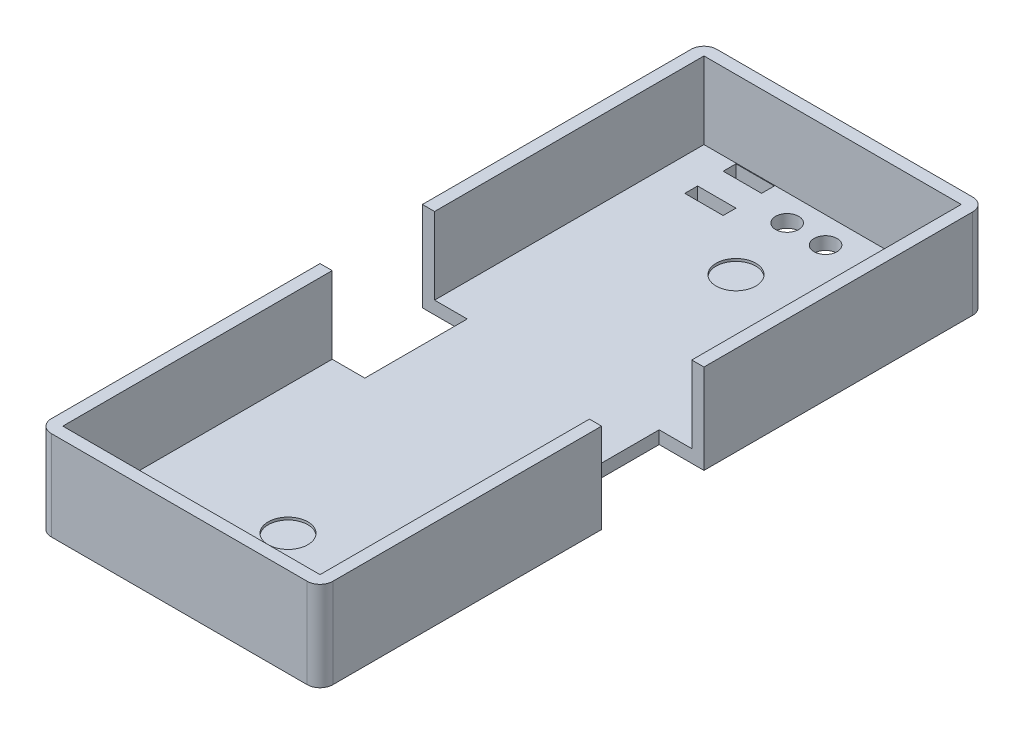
ISO-10303-21;
HEADER;
FILE_DESCRIPTION(('STEP AP214'),'2;1');
FILE_NAME('part.step','',(''),(''),'','','');
FILE_SCHEMA(('AUTOMOTIVE_DESIGN { 1 0 10303 214 1 1 1 1 }'));
ENDSEC;
DATA;
#1=APPLICATION_CONTEXT('core data for automotive mechanical design processes');
#2=APPLICATION_PROTOCOL_DEFINITION('international standard','automotive_design',2000,#1);
#3=PRODUCT_CONTEXT('',#1,'mechanical');
#4=PRODUCT('Part','Part','',(#3));
#5=PRODUCT_RELATED_PRODUCT_CATEGORY('part','',(#4));
#6=PRODUCT_DEFINITION_FORMATION('','',#4);
#7=PRODUCT_DEFINITION_CONTEXT('part definition',#1,'design');
#8=PRODUCT_DEFINITION('design','',#6,#7);
#9=PRODUCT_DEFINITION_SHAPE('','',#8);
#10=(LENGTH_UNIT() NAMED_UNIT(*) SI_UNIT(.MILLI.,.METRE.));
#11=(NAMED_UNIT(*) PLANE_ANGLE_UNIT() SI_UNIT($,.RADIAN.));
#12=(NAMED_UNIT(*) SI_UNIT($,.STERADIAN.) SOLID_ANGLE_UNIT());
#13=UNCERTAINTY_MEASURE_WITH_UNIT(LENGTH_MEASURE(1.E-05),#10,'distance_accuracy_value','');
#14=(GEOMETRIC_REPRESENTATION_CONTEXT(3) GLOBAL_UNCERTAINTY_ASSIGNED_CONTEXT((#13)) GLOBAL_UNIT_ASSIGNED_CONTEXT((#10,
#11,#12)) REPRESENTATION_CONTEXT('',''));
#15=CARTESIAN_POINT('',(0.,0.,0.));
#16=DIRECTION('',(0.,0.,1.));
#17=DIRECTION('',(1.,0.,0.));
#18=AXIS2_PLACEMENT_3D('',#15,#16,#17);
#19=CARTESIAN_POINT('',(11.,7.,26.));
#20=DIRECTION('',(-1.,0.,0.));
#21=DIRECTION('',(0.,0.,1.));
#22=AXIS2_PLACEMENT_3D('',#19,#20,#21);
#23=PLANE('',#22);
#24=DIRECTION('',(0.,0.,-1.));
#25=VECTOR('',#24,1.);
#26=CARTESIAN_POINT('',(11.,7.,26.));
#27=LINE('',#26,#25);
#28=CARTESIAN_POINT('',(11.,7.,-4.00000000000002));
#29=VERTEX_POINT('',#28);
#30=CARTESIAN_POINT('',(11.,7.,-25.));
#31=VERTEX_POINT('',#30);
#32=EDGE_CURVE('E359',#29,#31,#27,.T.);
#33=ORIENTED_EDGE('',*,*,#32,.F.);
#34=DIRECTION('',(0.,-1.,0.));
#35=VECTOR('',#34,1.);
#36=CARTESIAN_POINT('',(11.,7.,-4.00000000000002));
#37=LINE('',#36,#35);
#38=CARTESIAN_POINT('',(11.,0.,-4.00000000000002));
#39=VERTEX_POINT('',#38);
#40=EDGE_CURVE('E767',#29,#39,#37,.T.);
#41=ORIENTED_EDGE('',*,*,#40,.T.);
#42=DIRECTION('',(0.,0.,-1.));
#43=VECTOR('',#42,1.);
#44=CARTESIAN_POINT('',(11.,0.,26.));
#45=LINE('',#44,#43);
#46=CARTESIAN_POINT('',(11.,0.,-25.));
#47=VERTEX_POINT('',#46);
#48=EDGE_CURVE('E346',#39,#47,#45,.T.);
#49=ORIENTED_EDGE('',*,*,#48,.T.);
#50=DIRECTION('',(0.,-1.,0.));
#51=VECTOR('',#50,1.);
#52=CARTESIAN_POINT('',(11.,7.,-25.));
#53=LINE('',#52,#51);
#54=EDGE_CURVE('E398',#47,#31,#53,.F.);
#55=ORIENTED_EDGE('',*,*,#54,.T.);
#56=EDGE_LOOP('',(#33,#41,#49,#55));
#57=FACE_BOUND('',#56,.T.);
#58=ADVANCED_FACE('F39',(#57),#23,.F.);
#59=CARTESIAN_POINT('',(-11.,7.,26.));
#60=DIRECTION('',(1.,0.,0.));
#61=DIRECTION('',(0.,0.,-1.));
#62=AXIS2_PLACEMENT_3D('',#59,#60,#61);
#63=PLANE('',#62);
#64=DIRECTION('',(0.,0.,1.));
#65=VECTOR('',#64,1.);
#66=CARTESIAN_POINT('',(-11.,0.,26.));
#67=LINE('',#66,#65);
#68=CARTESIAN_POINT('',(-11.,0.,-25.));
#69=VERTEX_POINT('',#68);
#70=CARTESIAN_POINT('',(-11.,0.,-4.));
#71=VERTEX_POINT('',#70);
#72=EDGE_CURVE('E351',#69,#71,#67,.T.);
#73=ORIENTED_EDGE('',*,*,#72,.T.);
#74=DIRECTION('',(0.,-1.,0.));
#75=VECTOR('',#74,1.);
#76=CARTESIAN_POINT('',(-11.,7.,-4.));
#77=LINE('',#76,#75);
#78=CARTESIAN_POINT('',(-11.,7.,-4.));
#79=VERTEX_POINT('',#78);
#80=EDGE_CURVE('E307',#79,#71,#77,.T.);
#81=ORIENTED_EDGE('',*,*,#80,.F.);
#82=DIRECTION('',(0.,0.,1.));
#83=VECTOR('',#82,1.);
#84=CARTESIAN_POINT('',(-11.,7.,26.));
#85=LINE('',#84,#83);
#86=CARTESIAN_POINT('',(-11.,7.,-25.));
#87=VERTEX_POINT('',#86);
#88=EDGE_CURVE('E325',#87,#79,#85,.T.);
#89=ORIENTED_EDGE('',*,*,#88,.F.);
#90=DIRECTION('',(0.,-1.,0.));
#91=VECTOR('',#90,1.);
#92=CARTESIAN_POINT('',(-11.,7.,-25.));
#93=LINE('',#92,#91);
#94=EDGE_CURVE('E380',#87,#69,#93,.T.);
#95=ORIENTED_EDGE('',*,*,#94,.T.);
#96=EDGE_LOOP('',(#73,#81,#89,#95));
#97=FACE_BOUND('',#96,.T.);
#98=ADVANCED_FACE('F594',(#97),#63,.F.);
#99=CARTESIAN_POINT('',(0.,7.,0.));
#100=DIRECTION('',(0.,-1.,0.));
#101=DIRECTION('',(0.,0.,-1.));
#102=AXIS2_PLACEMENT_3D('',#99,#100,#101);
#103=PLANE('',#102);
#104=ORIENTED_EDGE('',*,*,#88,.T.);
#105=DIRECTION('',(1.,0.,0.));
#106=VECTOR('',#105,1.);
#107=CARTESIAN_POINT('',(-7.50000000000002,7.,-4.));
#108=LINE('',#107,#106);
#109=CARTESIAN_POINT('',(-10.05,7.,-4.));
#110=VERTEX_POINT('',#109);
#111=EDGE_CURVE('E318',#79,#110,#108,.T.);
#112=ORIENTED_EDGE('',*,*,#111,.T.);
#113=DIRECTION('',(0.,0.,1.));
#114=VECTOR('',#113,1.);
#115=CARTESIAN_POINT('',(-10.05,7.,25.05));
#116=LINE('',#115,#114);
#117=CARTESIAN_POINT('',(-10.05,7.,-25.05));
#118=VERTEX_POINT('',#117);
#119=EDGE_CURVE('E541',#118,#110,#116,.T.);
#120=ORIENTED_EDGE('',*,*,#119,.F.);
#121=DIRECTION('',(-1.,0.,0.));
#122=VECTOR('',#121,1.);
#123=CARTESIAN_POINT('',(-10.05,7.,-25.05));
#124=LINE('',#123,#122);
#125=CARTESIAN_POINT('',(10.05,7.,-25.05));
#126=VERTEX_POINT('',#125);
#127=EDGE_CURVE('E537',#126,#118,#124,.T.);
#128=ORIENTED_EDGE('',*,*,#127,.F.);
#129=DIRECTION('',(0.,0.,-1.));
#130=VECTOR('',#129,1.);
#131=CARTESIAN_POINT('',(10.05,7.,25.05));
#132=LINE('',#131,#130);
#133=CARTESIAN_POINT('',(10.05,7.,-4.00000000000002));
#134=VERTEX_POINT('',#133);
#135=EDGE_CURVE('E423',#134,#126,#132,.T.);
#136=ORIENTED_EDGE('',*,*,#135,.F.);
#137=DIRECTION('',(1.,0.,0.));
#138=VECTOR('',#137,1.);
#139=CARTESIAN_POINT('',(7.50000000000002,7.,-4.00000000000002));
#140=LINE('',#139,#138);
#141=EDGE_CURVE('E572',#134,#29,#140,.T.);
#142=ORIENTED_EDGE('',*,*,#141,.T.);
#143=ORIENTED_EDGE('',*,*,#32,.T.);
#144=CARTESIAN_POINT('',(9.99999999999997,7.,-25.));
#145=DIRECTION('',(0.,-1.,0.));
#146=DIRECTION('',(0.,0.,-1.));
#147=AXIS2_PLACEMENT_3D('',#144,#145,#146);
#148=CIRCLE('',#147,1.);
#149=CARTESIAN_POINT('',(9.99999999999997,7.,-26.));
#150=VERTEX_POINT('',#149);
#151=EDGE_CURVE('E389',#31,#150,#148,.F.);
#152=ORIENTED_EDGE('',*,*,#151,.T.);
#153=DIRECTION('',(-1.,0.,0.));
#154=VECTOR('',#153,1.);
#155=CARTESIAN_POINT('',(-11.,7.,-26.));
#156=LINE('',#155,#154);
#157=CARTESIAN_POINT('',(-10.,7.,-26.));
#158=VERTEX_POINT('',#157);
#159=EDGE_CURVE('E326',#150,#158,#156,.T.);
#160=ORIENTED_EDGE('',*,*,#159,.T.);
#161=CARTESIAN_POINT('',(-10.,7.,-25.));
#162=DIRECTION('',(0.,-1.,0.));
#163=DIRECTION('',(0.,0.,-1.));
#164=AXIS2_PLACEMENT_3D('',#161,#162,#163);
#165=CIRCLE('',#164,1.);
#166=EDGE_CURVE('E386',#158,#87,#165,.F.);
#167=ORIENTED_EDGE('',*,*,#166,.T.);
#168=EDGE_LOOP('',(#104,#112,#120,#128,#136,#142,#143,#152,#160,#167));
#169=FACE_BOUND('',#168,.T.);
#170=ADVANCED_FACE('F568',(#169),#103,.F.);
#171=CARTESIAN_POINT('',(10.05,1.,25.05));
#172=DIRECTION('',(1.,0.,0.));
#173=DIRECTION('',(0.,0.,-1.));
#174=AXIS2_PLACEMENT_3D('',#171,#172,#173);
#175=PLANE('',#174);
#176=DIRECTION('',(0.,0.,-1.));
#177=VECTOR('',#176,1.);
#178=CARTESIAN_POINT('',(10.05,1.,25.05));
#179=LINE('',#178,#177);
#180=CARTESIAN_POINT('',(10.05,1.,-4.00000000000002));
#181=VERTEX_POINT('',#180);
#182=CARTESIAN_POINT('',(10.05,1.,-25.05));
#183=VERTEX_POINT('',#182);
#184=EDGE_CURVE('E549',#181,#183,#179,.T.);
#185=ORIENTED_EDGE('',*,*,#184,.F.);
#186=DIRECTION('',(0.,1.,0.));
#187=VECTOR('',#186,1.);
#188=CARTESIAN_POINT('',(10.05,1.,-4.00000000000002));
#189=LINE('',#188,#187);
#190=EDGE_CURVE('E737',#181,#134,#189,.T.);
#191=ORIENTED_EDGE('',*,*,#190,.T.);
#192=ORIENTED_EDGE('',*,*,#135,.T.);
#193=DIRECTION('',(0.,1.,0.));
#194=VECTOR('',#193,1.);
#195=CARTESIAN_POINT('',(10.05,1.,-25.05));
#196=LINE('',#195,#194);
#197=EDGE_CURVE('E532',#183,#126,#196,.T.);
#198=ORIENTED_EDGE('',*,*,#197,.F.);
#199=EDGE_LOOP('',(#185,#191,#192,#198));
#200=FACE_BOUND('',#199,.T.);
#201=ADVANCED_FACE('F808',(#200),#175,.F.);
#202=CARTESIAN_POINT('',(-10.05,1.,25.05));
#203=DIRECTION('',(-1.,0.,0.));
#204=DIRECTION('',(0.,0.,1.));
#205=AXIS2_PLACEMENT_3D('',#202,#203,#204);
#206=PLANE('',#205);
#207=ORIENTED_EDGE('',*,*,#119,.T.);
#208=DIRECTION('',(0.,-1.,0.));
#209=VECTOR('',#208,1.);
#210=CARTESIAN_POINT('',(-10.05,1.,-4.));
#211=LINE('',#210,#209);
#212=CARTESIAN_POINT('',(-10.05,1.,-4.));
#213=VERTEX_POINT('',#212);
#214=EDGE_CURVE('E606',#110,#213,#211,.T.);
#215=ORIENTED_EDGE('',*,*,#214,.T.);
#216=DIRECTION('',(0.,0.,1.));
#217=VECTOR('',#216,1.);
#218=CARTESIAN_POINT('',(-10.05,1.,25.05));
#219=LINE('',#218,#217);
#220=CARTESIAN_POINT('',(-10.05,1.,-25.05));
#221=VERTEX_POINT('',#220);
#222=EDGE_CURVE('E519',#221,#213,#219,.T.);
#223=ORIENTED_EDGE('',*,*,#222,.F.);
#224=DIRECTION('',(0.,1.,0.));
#225=VECTOR('',#224,1.);
#226=CARTESIAN_POINT('',(-10.05,1.,-25.05));
#227=LINE('',#226,#225);
#228=EDGE_CURVE('E555',#221,#118,#227,.T.);
#229=ORIENTED_EDGE('',*,*,#228,.T.);
#230=EDGE_LOOP('',(#207,#215,#223,#229));
#231=FACE_BOUND('',#230,.T.);
#232=ADVANCED_FACE('F604',(#231),#206,.F.);
#233=CARTESIAN_POINT('',(11.,0.,25.));
#234=VERTEX_POINT('',#233);
#235=CARTESIAN_POINT('',(11.,0.,3.99999999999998));
#236=VERTEX_POINT('',#235);
#237=EDGE_CURVE('E341',#234,#236,#45,.T.);
#238=ORIENTED_EDGE('',*,*,#237,.T.);
#239=DIRECTION('',(0.,-1.,0.));
#240=VECTOR('',#239,1.);
#241=CARTESIAN_POINT('',(11.,7.,3.99999999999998));
#242=LINE('',#241,#240);
#243=CARTESIAN_POINT('',(11.,7.,3.99999999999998));
#244=VERTEX_POINT('',#243);
#245=EDGE_CURVE('E764',#244,#236,#242,.T.);
#246=ORIENTED_EDGE('',*,*,#245,.F.);
#247=CARTESIAN_POINT('',(11.,7.,25.));
#248=VERTEX_POINT('',#247);
#249=EDGE_CURVE('E333',#248,#244,#27,.T.);
#250=ORIENTED_EDGE('',*,*,#249,.F.);
#251=DIRECTION('',(0.,-1.,0.));
#252=VECTOR('',#251,1.);
#253=CARTESIAN_POINT('',(11.,7.,25.));
#254=LINE('',#253,#252);
#255=EDGE_CURVE('E402',#248,#234,#254,.T.);
#256=ORIENTED_EDGE('',*,*,#255,.T.);
#257=EDGE_LOOP('',(#238,#246,#250,#256));
#258=FACE_BOUND('',#257,.T.);
#259=ADVANCED_FACE('F816',(#258),#23,.F.);
#260=CARTESIAN_POINT('',(-11.,7.,-26.));
#261=DIRECTION('',(0.,0.,1.));
#262=DIRECTION('',(1.,0.,0.));
#263=AXIS2_PLACEMENT_3D('',#260,#261,#262);
#264=PLANE('',#263);
#265=ORIENTED_EDGE('',*,*,#159,.F.);
#266=DIRECTION('',(0.,-1.,0.));
#267=VECTOR('',#266,1.);
#268=CARTESIAN_POINT('',(9.99999999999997,7.,-26.));
#269=LINE('',#268,#267);
#270=CARTESIAN_POINT('',(9.99999999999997,0.,-26.));
#271=VERTEX_POINT('',#270);
#272=EDGE_CURVE('E409',#150,#271,#269,.T.);
#273=ORIENTED_EDGE('',*,*,#272,.T.);
#274=DIRECTION('',(-1.,0.,0.));
#275=VECTOR('',#274,1.);
#276=CARTESIAN_POINT('',(-11.,0.,-26.));
#277=LINE('',#276,#275);
#278=CARTESIAN_POINT('',(-10.,0.,-26.));
#279=VERTEX_POINT('',#278);
#280=EDGE_CURVE('E345',#271,#279,#277,.T.);
#281=ORIENTED_EDGE('',*,*,#280,.T.);
#282=DIRECTION('',(0.,-1.,0.));
#283=VECTOR('',#282,1.);
#284=CARTESIAN_POINT('',(-10.,7.,-26.));
#285=LINE('',#284,#283);
#286=EDGE_CURVE('E406',#279,#158,#285,.F.);
#287=ORIENTED_EDGE('',*,*,#286,.T.);
#288=EDGE_LOOP('',(#265,#273,#281,#287));
#289=FACE_BOUND('',#288,.T.);
#290=ADVANCED_FACE('F582',(#289),#264,.F.);
#291=CARTESIAN_POINT('',(-11.,7.,4.));
#292=VERTEX_POINT('',#291);
#293=CARTESIAN_POINT('',(-11.,7.,25.));
#294=VERTEX_POINT('',#293);
#295=EDGE_CURVE('E312',#292,#294,#85,.T.);
#296=ORIENTED_EDGE('',*,*,#295,.F.);
#297=DIRECTION('',(0.,-1.,0.));
#298=VECTOR('',#297,1.);
#299=CARTESIAN_POINT('',(-11.,7.,4.));
#300=LINE('',#299,#298);
#301=CARTESIAN_POINT('',(-11.,0.,4.));
#302=VERTEX_POINT('',#301);
#303=EDGE_CURVE('E296',#292,#302,#300,.T.);
#304=ORIENTED_EDGE('',*,*,#303,.T.);
#305=CARTESIAN_POINT('',(-11.,0.,25.));
#306=VERTEX_POINT('',#305);
#307=EDGE_CURVE('E350',#302,#306,#67,.T.);
#308=ORIENTED_EDGE('',*,*,#307,.T.);
#309=DIRECTION('',(0.,-1.,0.));
#310=VECTOR('',#309,1.);
#311=CARTESIAN_POINT('',(-11.,7.,25.));
#312=LINE('',#311,#310);
#313=EDGE_CURVE('E322',#306,#294,#312,.F.);
#314=ORIENTED_EDGE('',*,*,#313,.T.);
#315=EDGE_LOOP('',(#296,#304,#308,#314));
#316=FACE_BOUND('',#315,.T.);
#317=ADVANCED_FACE('F320',(#316),#63,.F.);
#318=CARTESIAN_POINT('',(-11.,7.,26.));
#319=DIRECTION('',(0.,0.,-1.));
#320=DIRECTION('',(-1.,0.,0.));
#321=AXIS2_PLACEMENT_3D('',#318,#319,#320);
#322=PLANE('',#321);
#323=DIRECTION('',(1.,0.,0.));
#324=VECTOR('',#323,1.);
#325=CARTESIAN_POINT('',(-11.,7.,26.));
#326=LINE('',#325,#324);
#327=CARTESIAN_POINT('',(-10.,7.,26.));
#328=VERTEX_POINT('',#327);
#329=CARTESIAN_POINT('',(9.99999999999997,7.,26.));
#330=VERTEX_POINT('',#329);
#331=EDGE_CURVE('E331',#328,#330,#326,.T.);
#332=ORIENTED_EDGE('',*,*,#331,.F.);
#333=DIRECTION('',(0.,-1.,0.));
#334=VECTOR('',#333,1.);
#335=CARTESIAN_POINT('',(-10.,7.,26.));
#336=LINE('',#335,#334);
#337=CARTESIAN_POINT('',(-10.,0.,26.));
#338=VERTEX_POINT('',#337);
#339=EDGE_CURVE('E362',#328,#338,#336,.T.);
#340=ORIENTED_EDGE('',*,*,#339,.T.);
#341=DIRECTION('',(1.,0.,0.));
#342=VECTOR('',#341,1.);
#343=CARTESIAN_POINT('',(-11.,0.,26.));
#344=LINE('',#343,#342);
#345=CARTESIAN_POINT('',(9.99999999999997,0.,26.));
#346=VERTEX_POINT('',#345);
#347=EDGE_CURVE('E355',#338,#346,#344,.T.);
#348=ORIENTED_EDGE('',*,*,#347,.T.);
#349=DIRECTION('',(0.,-1.,0.));
#350=VECTOR('',#349,1.);
#351=CARTESIAN_POINT('',(9.99999999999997,7.,26.));
#352=LINE('',#351,#350);
#353=EDGE_CURVE('E340',#346,#330,#352,.F.);
#354=ORIENTED_EDGE('',*,*,#353,.T.);
#355=EDGE_LOOP('',(#332,#340,#348,#354));
#356=FACE_BOUND('',#355,.T.);
#357=ADVANCED_FACE('F988',(#356),#322,.F.);
#358=CARTESIAN_POINT('',(-10.05,7.,4.));
#359=VERTEX_POINT('',#358);
#360=CARTESIAN_POINT('',(-10.05,7.,25.05));
#361=VERTEX_POINT('',#360);
#362=EDGE_CURVE('E315',#359,#361,#116,.T.);
#363=ORIENTED_EDGE('',*,*,#362,.F.);
#364=DIRECTION('',(-1.,0.,0.));
#365=VECTOR('',#364,1.);
#366=CARTESIAN_POINT('',(-11.,7.,4.));
#367=LINE('',#366,#365);
#368=EDGE_CURVE('E299',#359,#292,#367,.T.);
#369=ORIENTED_EDGE('',*,*,#368,.T.);
#370=ORIENTED_EDGE('',*,*,#295,.T.);
#371=CARTESIAN_POINT('',(-10.,7.,25.));
#372=DIRECTION('',(0.,-1.,0.));
#373=DIRECTION('',(0.,0.,-1.));
#374=AXIS2_PLACEMENT_3D('',#371,#372,#373);
#375=CIRCLE('',#374,1.);
#376=EDGE_CURVE('E395',#294,#328,#375,.F.);
#377=ORIENTED_EDGE('',*,*,#376,.T.);
#378=ORIENTED_EDGE('',*,*,#331,.T.);
#379=CARTESIAN_POINT('',(9.99999999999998,7.,25.));
#380=DIRECTION('',(0.,-1.,0.));
#381=DIRECTION('',(0.,0.,-1.));
#382=AXIS2_PLACEMENT_3D('',#379,#380,#381);
#383=CIRCLE('',#382,1.);
#384=EDGE_CURVE('E392',#330,#248,#383,.F.);
#385=ORIENTED_EDGE('',*,*,#384,.T.);
#386=ORIENTED_EDGE('',*,*,#249,.T.);
#387=DIRECTION('',(-1.,0.,0.));
#388=VECTOR('',#387,1.);
#389=CARTESIAN_POINT('',(11.,7.,3.99999999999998));
#390=LINE('',#389,#388);
#391=CARTESIAN_POINT('',(10.05,7.,3.99999999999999));
#392=VERTEX_POINT('',#391);
#393=EDGE_CURVE('E770',#244,#392,#390,.T.);
#394=ORIENTED_EDGE('',*,*,#393,.T.);
#395=CARTESIAN_POINT('',(10.05,7.,25.05));
#396=VERTEX_POINT('',#395);
#397=EDGE_CURVE('E533',#396,#392,#132,.T.);
#398=ORIENTED_EDGE('',*,*,#397,.F.);
#399=DIRECTION('',(1.,0.,0.));
#400=VECTOR('',#399,1.);
#401=CARTESIAN_POINT('',(-10.05,7.,25.05));
#402=LINE('',#401,#400);
#403=EDGE_CURVE('E545',#361,#396,#402,.T.);
#404=ORIENTED_EDGE('',*,*,#403,.F.);
#405=EDGE_LOOP('',(#363,#369,#370,#377,#378,#385,#386,#394,#398,#404));
#406=FACE_BOUND('',#405,.T.);
#407=ADVANCED_FACE('F311',(#406),#103,.F.);
#408=CARTESIAN_POINT('',(0.,0.,0.));
#409=DIRECTION('',(0.,-1.,0.));
#410=DIRECTION('',(0.,0.,-1.));
#411=AXIS2_PLACEMENT_3D('',#408,#409,#410);
#412=PLANE('',#411);
#413=DIRECTION('',(1.,0.,0.));
#414=VECTOR('',#413,1.);
#415=CARTESIAN_POINT('',(-7.50000000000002,0.,-4.));
#416=LINE('',#415,#414);
#417=CARTESIAN_POINT('',(-7.50000000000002,0.,-4.));
#418=VERTEX_POINT('',#417);
#419=EDGE_CURVE('E755',#71,#418,#416,.T.);
#420=ORIENTED_EDGE('',*,*,#419,.F.);
#421=ORIENTED_EDGE('',*,*,#72,.F.);
#422=CARTESIAN_POINT('',(-10.,0.,-25.));
#423=DIRECTION('',(0.,-1.,0.));
#424=DIRECTION('',(0.,0.,-1.));
#425=AXIS2_PLACEMENT_3D('',#422,#423,#424);
#426=CIRCLE('',#425,1.);
#427=EDGE_CURVE('E366',#69,#279,#426,.T.);
#428=ORIENTED_EDGE('',*,*,#427,.T.);
#429=ORIENTED_EDGE('',*,*,#280,.F.);
#430=CARTESIAN_POINT('',(9.99999999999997,0.,-25.));
#431=DIRECTION('',(0.,-1.,0.));
#432=DIRECTION('',(0.,0.,-1.));
#433=AXIS2_PLACEMENT_3D('',#430,#431,#432);
#434=CIRCLE('',#433,1.);
#435=EDGE_CURVE('E369',#271,#47,#434,.T.);
#436=ORIENTED_EDGE('',*,*,#435,.T.);
#437=ORIENTED_EDGE('',*,*,#48,.F.);
#438=DIRECTION('',(1.,0.,0.));
#439=VECTOR('',#438,1.);
#440=CARTESIAN_POINT('',(7.50000000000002,0.,-4.00000000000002));
#441=LINE('',#440,#439);
#442=CARTESIAN_POINT('',(7.50000000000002,0.,-4.00000000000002));
#443=VERTEX_POINT('',#442);
#444=EDGE_CURVE('E782',#443,#39,#441,.T.);
#445=ORIENTED_EDGE('',*,*,#444,.F.);
#446=DIRECTION('',(0.,0.,-1.));
#447=VECTOR('',#446,1.);
#448=CARTESIAN_POINT('',(7.50000000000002,0.,-4.00000000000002));
#449=LINE('',#448,#447);
#450=CARTESIAN_POINT('',(7.50000000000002,0.,3.99999999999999));
#451=VERTEX_POINT('',#450);
#452=EDGE_CURVE('E775',#451,#443,#449,.T.);
#453=ORIENTED_EDGE('',*,*,#452,.F.);
#454=DIRECTION('',(-1.,0.,0.));
#455=VECTOR('',#454,1.);
#456=CARTESIAN_POINT('',(11.,0.,3.99999999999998));
#457=LINE('',#456,#455);
#458=EDGE_CURVE('E779',#236,#451,#457,.T.);
#459=ORIENTED_EDGE('',*,*,#458,.F.);
#460=ORIENTED_EDGE('',*,*,#237,.F.);
#461=CARTESIAN_POINT('',(9.99999999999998,0.,25.));
#462=DIRECTION('',(0.,-1.,0.));
#463=DIRECTION('',(0.,0.,-1.));
#464=AXIS2_PLACEMENT_3D('',#461,#462,#463);
#465=CIRCLE('',#464,1.);
#466=EDGE_CURVE('E373',#234,#346,#465,.T.);
#467=ORIENTED_EDGE('',*,*,#466,.T.);
#468=ORIENTED_EDGE('',*,*,#347,.F.);
#469=CARTESIAN_POINT('',(-10.,0.,25.));
#470=DIRECTION('',(0.,-1.,0.));
#471=DIRECTION('',(0.,0.,-1.));
#472=AXIS2_PLACEMENT_3D('',#469,#470,#471);
#473=CIRCLE('',#472,1.);
#474=EDGE_CURVE('E376',#338,#306,#473,.T.);
#475=ORIENTED_EDGE('',*,*,#474,.T.);
#476=ORIENTED_EDGE('',*,*,#307,.F.);
#477=DIRECTION('',(-1.,0.,0.));
#478=VECTOR('',#477,1.);
#479=CARTESIAN_POINT('',(-11.,0.,4.));
#480=LINE('',#479,#478);
#481=CARTESIAN_POINT('',(-7.50000000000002,0.,4.));
#482=VERTEX_POINT('',#481);
#483=EDGE_CURVE('E302',#482,#302,#480,.T.);
#484=ORIENTED_EDGE('',*,*,#483,.F.);
#485=DIRECTION('',(0.,0.,1.));
#486=VECTOR('',#485,1.);
#487=CARTESIAN_POINT('',(-7.50000000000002,0.,-4.));
#488=LINE('',#487,#486);
#489=EDGE_CURVE('E752',#418,#482,#488,.T.);
#490=ORIENTED_EDGE('',*,*,#489,.F.);
#491=EDGE_LOOP('',(#420,#421,#428,#429,#436,#437,#445,#453,#459,#460,#467,#468,#475,#476,#484,#490));
#492=FACE_BOUND('',#491,.T.);
#493=DIRECTION('',(0.,0.,1.));
#494=VECTOR('',#493,1.);
#495=CARTESIAN_POINT('',(-4.5,0.,-25.));
#496=LINE('',#495,#494);
#497=CARTESIAN_POINT('',(-4.5,0.,-25.));
#498=VERTEX_POINT('',#497);
#499=CARTESIAN_POINT('',(-4.5,0.,-24.));
#500=VERTEX_POINT('',#499);
#501=EDGE_CURVE('E642',#498,#500,#496,.T.);
#502=ORIENTED_EDGE('',*,*,#501,.F.);
#503=DIRECTION('',(1.,0.,0.));
#504=VECTOR('',#503,1.);
#505=CARTESIAN_POINT('',(-4.5,0.,-25.));
#506=LINE('',#505,#504);
#507=CARTESIAN_POINT('',(-7.5,0.,-25.));
#508=VERTEX_POINT('',#507);
#509=EDGE_CURVE('E630',#508,#498,#506,.T.);
#510=ORIENTED_EDGE('',*,*,#509,.F.);
#511=DIRECTION('',(0.,0.,-1.));
#512=VECTOR('',#511,1.);
#513=CARTESIAN_POINT('',(-7.5,0.,-25.));
#514=LINE('',#513,#512);
#515=CARTESIAN_POINT('',(-7.5,0.,-24.));
#516=VERTEX_POINT('',#515);
#517=EDGE_CURVE('E634',#516,#508,#514,.T.);
#518=ORIENTED_EDGE('',*,*,#517,.F.);
#519=DIRECTION('',(-1.,0.,0.));
#520=VECTOR('',#519,1.);
#521=CARTESIAN_POINT('',(-4.5,0.,-24.));
#522=LINE('',#521,#520);
#523=EDGE_CURVE('E638',#500,#516,#522,.T.);
#524=ORIENTED_EDGE('',*,*,#523,.F.);
#525=EDGE_LOOP('',(#502,#510,#518,#524));
#526=FACE_BOUND('',#525,.T.);
#527=DIRECTION('',(0.,0.,1.));
#528=VECTOR('',#527,1.);
#529=CARTESIAN_POINT('',(-4.5,0.,-21.));
#530=LINE('',#529,#528);
#531=CARTESIAN_POINT('',(-4.5,0.,-22.));
#532=VERTEX_POINT('',#531);
#533=CARTESIAN_POINT('',(-4.5,0.,-21.));
#534=VERTEX_POINT('',#533);
#535=EDGE_CURVE('E670',#532,#534,#530,.T.);
#536=ORIENTED_EDGE('',*,*,#535,.F.);
#537=DIRECTION('',(1.,0.,0.));
#538=VECTOR('',#537,1.);
#539=CARTESIAN_POINT('',(-4.5,0.,-22.));
#540=LINE('',#539,#538);
#541=CARTESIAN_POINT('',(-7.5,0.,-22.));
#542=VERTEX_POINT('',#541);
#543=EDGE_CURVE('E658',#542,#532,#540,.T.);
#544=ORIENTED_EDGE('',*,*,#543,.F.);
#545=DIRECTION('',(0.,0.,-1.));
#546=VECTOR('',#545,1.);
#547=CARTESIAN_POINT('',(-7.5,0.,-21.));
#548=LINE('',#547,#546);
#549=CARTESIAN_POINT('',(-7.5,0.,-21.));
#550=VERTEX_POINT('',#549);
#551=EDGE_CURVE('E662',#550,#542,#548,.T.);
#552=ORIENTED_EDGE('',*,*,#551,.F.);
#553=DIRECTION('',(-1.,0.,0.));
#554=VECTOR('',#553,1.);
#555=CARTESIAN_POINT('',(-4.5,0.,-21.));
#556=LINE('',#555,#554);
#557=EDGE_CURVE('E666',#534,#550,#556,.T.);
#558=ORIENTED_EDGE('',*,*,#557,.F.);
#559=EDGE_LOOP('',(#536,#544,#552,#558));
#560=FACE_BOUND('',#559,.T.);
#561=DIRECTION('',(0.,0.,-1.));
#562=VECTOR('',#561,1.);
#563=CARTESIAN_POINT('',(4.5,0.,-21.));
#564=LINE('',#563,#562);
#565=CARTESIAN_POINT('',(4.5,0.,-21.));
#566=VERTEX_POINT('',#565);
#567=CARTESIAN_POINT('',(4.5,0.,-22.));
#568=VERTEX_POINT('',#567);
#569=EDGE_CURVE('E698',#566,#568,#564,.T.);
#570=ORIENTED_EDGE('',*,*,#569,.F.);
#571=DIRECTION('',(-1.,0.,0.));
#572=VECTOR('',#571,1.);
#573=CARTESIAN_POINT('',(4.5,0.,-21.));
#574=LINE('',#573,#572);
#575=CARTESIAN_POINT('',(7.5,0.,-21.));
#576=VERTEX_POINT('',#575);
#577=EDGE_CURVE('E686',#576,#566,#574,.T.);
#578=ORIENTED_EDGE('',*,*,#577,.F.);
#579=DIRECTION('',(0.,0.,1.));
#580=VECTOR('',#579,1.);
#581=CARTESIAN_POINT('',(7.5,0.,-21.));
#582=LINE('',#581,#580);
#583=CARTESIAN_POINT('',(7.5,0.,-22.));
#584=VERTEX_POINT('',#583);
#585=EDGE_CURVE('E690',#584,#576,#582,.T.);
#586=ORIENTED_EDGE('',*,*,#585,.F.);
#587=DIRECTION('',(1.,0.,0.));
#588=VECTOR('',#587,1.);
#589=CARTESIAN_POINT('',(4.5,0.,-22.));
#590=LINE('',#589,#588);
#591=EDGE_CURVE('E694',#568,#584,#590,.T.);
#592=ORIENTED_EDGE('',*,*,#591,.F.);
#593=EDGE_LOOP('',(#570,#578,#586,#592));
#594=FACE_BOUND('',#593,.T.);
#595=DIRECTION('',(1.,0.,0.));
#596=VECTOR('',#595,1.);
#597=CARTESIAN_POINT('',(4.5,0.,-25.));
#598=LINE('',#597,#596);
#599=CARTESIAN_POINT('',(4.5,0.,-25.));
#600=VERTEX_POINT('',#599);
#601=CARTESIAN_POINT('',(7.5,0.,-25.));
#602=VERTEX_POINT('',#601);
#603=EDGE_CURVE('E726',#600,#602,#598,.T.);
#604=ORIENTED_EDGE('',*,*,#603,.F.);
#605=DIRECTION('',(0.,0.,-1.));
#606=VECTOR('',#605,1.);
#607=CARTESIAN_POINT('',(4.5,0.,-25.));
#608=LINE('',#607,#606);
#609=CARTESIAN_POINT('',(4.5,0.,-24.));
#610=VERTEX_POINT('',#609);
#611=EDGE_CURVE('E714',#610,#600,#608,.T.);
#612=ORIENTED_EDGE('',*,*,#611,.F.);
#613=DIRECTION('',(-1.,0.,0.));
#614=VECTOR('',#613,1.);
#615=CARTESIAN_POINT('',(4.5,0.,-24.));
#616=LINE('',#615,#614);
#617=CARTESIAN_POINT('',(7.5,0.,-24.));
#618=VERTEX_POINT('',#617);
#619=EDGE_CURVE('E718',#618,#610,#616,.T.);
#620=ORIENTED_EDGE('',*,*,#619,.F.);
#621=DIRECTION('',(0.,0.,1.));
#622=VECTOR('',#621,1.);
#623=CARTESIAN_POINT('',(7.5,0.,-25.));
#624=LINE('',#623,#622);
#625=EDGE_CURVE('E722',#602,#618,#624,.T.);
#626=ORIENTED_EDGE('',*,*,#625,.F.);
#627=EDGE_LOOP('',(#604,#612,#620,#626));
#628=FACE_BOUND('',#627,.T.);
#629=CARTESIAN_POINT('',(1.5,0.,-23.));
#630=DIRECTION('',(0.,-1.,0.));
#631=DIRECTION('',(0.,0.,1.));
#632=AXIS2_PLACEMENT_3D('',#629,#630,#631);
#633=CIRCLE('',#632,0.900000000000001);
#634=CARTESIAN_POINT('',(1.5,0.,-22.1));
#635=VERTEX_POINT('',#634);
#636=EDGE_CURVE('E729',#635,#635,#633,.T.);
#637=ORIENTED_EDGE('',*,*,#636,.F.);
#638=EDGE_LOOP('',(#637));
#639=FACE_BOUND('',#638,.T.);
#640=CARTESIAN_POINT('',(-1.5,0.,-23.));
#641=DIRECTION('',(0.,-1.,0.));
#642=DIRECTION('',(0.,0.,-1.));
#643=AXIS2_PLACEMENT_3D('',#640,#641,#642);
#644=CIRCLE('',#643,0.9);
#645=CARTESIAN_POINT('',(-1.5,0.,-23.9));
#646=VERTEX_POINT('',#645);
#647=EDGE_CURVE('E419',#646,#646,#644,.T.);
#648=ORIENTED_EDGE('',*,*,#647,.F.);
#649=EDGE_LOOP('',(#648));
#650=FACE_BOUND('',#649,.T.);
#651=ADVANCED_FACE('F586',(#492,#526,#560,#594,#628,#639,#650),#412,.T.);
#652=ORIENTED_EDGE('',*,*,#397,.T.);
#653=DIRECTION('',(0.,-1.,0.));
#654=VECTOR('',#653,1.);
#655=CARTESIAN_POINT('',(10.05,1.,3.99999999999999));
#656=LINE('',#655,#654);
#657=CARTESIAN_POINT('',(10.05,1.,3.99999999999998));
#658=VERTEX_POINT('',#657);
#659=EDGE_CURVE('E740',#392,#658,#656,.T.);
#660=ORIENTED_EDGE('',*,*,#659,.T.);
#661=CARTESIAN_POINT('',(10.05,1.,25.05));
#662=VERTEX_POINT('',#661);
#663=EDGE_CURVE('E526',#662,#658,#179,.T.);
#664=ORIENTED_EDGE('',*,*,#663,.F.);
#665=DIRECTION('',(0.,1.,0.));
#666=VECTOR('',#665,1.);
#667=CARTESIAN_POINT('',(10.05,1.,25.05));
#668=LINE('',#667,#666);
#669=EDGE_CURVE('E550',#662,#396,#668,.T.);
#670=ORIENTED_EDGE('',*,*,#669,.T.);
#671=EDGE_LOOP('',(#652,#660,#664,#670));
#672=FACE_BOUND('',#671,.T.);
#673=ADVANCED_FACE('F811',(#672),#175,.F.);
#674=CARTESIAN_POINT('',(-10.05,1.,25.05));
#675=DIRECTION('',(0.,0.,1.));
#676=DIRECTION('',(1.,0.,0.));
#677=AXIS2_PLACEMENT_3D('',#674,#675,#676);
#678=PLANE('',#677);
#679=ORIENTED_EDGE('',*,*,#403,.T.);
#680=ORIENTED_EDGE('',*,*,#669,.F.);
#681=DIRECTION('',(1.,0.,0.));
#682=VECTOR('',#681,1.);
#683=CARTESIAN_POINT('',(-10.05,1.,25.05));
#684=LINE('',#683,#682);
#685=CARTESIAN_POINT('',(-10.05,1.,25.05));
#686=VERTEX_POINT('',#685);
#687=EDGE_CURVE('E524',#686,#662,#684,.T.);
#688=ORIENTED_EDGE('',*,*,#687,.F.);
#689=DIRECTION('',(0.,1.,0.));
#690=VECTOR('',#689,1.);
#691=CARTESIAN_POINT('',(-10.05,1.,25.05));
#692=LINE('',#691,#690);
#693=EDGE_CURVE('E516',#686,#361,#692,.T.);
#694=ORIENTED_EDGE('',*,*,#693,.T.);
#695=EDGE_LOOP('',(#679,#680,#688,#694));
#696=FACE_BOUND('',#695,.T.);
#697=ADVANCED_FACE('F821',(#696),#678,.F.);
#698=CARTESIAN_POINT('',(-10.05,1.,4.));
#699=VERTEX_POINT('',#698);
#700=EDGE_CURVE('E510',#699,#686,#219,.T.);
#701=ORIENTED_EDGE('',*,*,#700,.F.);
#702=DIRECTION('',(0.,1.,0.));
#703=VECTOR('',#702,1.);
#704=CARTESIAN_POINT('',(-10.05,1.,4.));
#705=LINE('',#704,#703);
#706=EDGE_CURVE('E514',#699,#359,#705,.T.);
#707=ORIENTED_EDGE('',*,*,#706,.T.);
#708=ORIENTED_EDGE('',*,*,#362,.T.);
#709=ORIENTED_EDGE('',*,*,#693,.F.);
#710=EDGE_LOOP('',(#701,#707,#708,#709));
#711=FACE_BOUND('',#710,.T.);
#712=ADVANCED_FACE('F513',(#711),#206,.F.);
#713=CARTESIAN_POINT('',(-10.05,1.,-25.05));
#714=DIRECTION('',(0.,0.,-1.));
#715=DIRECTION('',(-1.,0.,0.));
#716=AXIS2_PLACEMENT_3D('',#713,#714,#715);
#717=PLANE('',#716);
#718=ORIENTED_EDGE('',*,*,#127,.T.);
#719=ORIENTED_EDGE('',*,*,#228,.F.);
#720=DIRECTION('',(-1.,0.,0.));
#721=VECTOR('',#720,1.);
#722=CARTESIAN_POINT('',(-10.05,1.,-25.05));
#723=LINE('',#722,#721);
#724=EDGE_CURVE('E520',#183,#221,#723,.T.);
#725=ORIENTED_EDGE('',*,*,#724,.F.);
#726=ORIENTED_EDGE('',*,*,#197,.T.);
#727=EDGE_LOOP('',(#718,#719,#725,#726));
#728=FACE_BOUND('',#727,.T.);
#729=ADVANCED_FACE('F609',(#728),#717,.F.);
#730=CARTESIAN_POINT('',(0.,1.,0.));
#731=DIRECTION('',(0.,-1.,0.));
#732=DIRECTION('',(0.,0.,-1.));
#733=AXIS2_PLACEMENT_3D('',#730,#731,#732);
#734=PLANE('',#733);
#735=CARTESIAN_POINT('',(0.,1.,-17.5));
#736=DIRECTION('',(0.,1.,0.));
#737=DIRECTION('',(0.,0.,1.));
#738=AXIS2_PLACEMENT_3D('',#735,#736,#737);
#739=CIRCLE('',#738,1.55);
#740=CARTESIAN_POINT('',(0.,1.,-15.95));
#741=VERTEX_POINT('',#740);
#742=EDGE_CURVE('E789',#741,#741,#739,.T.);
#743=ORIENTED_EDGE('',*,*,#742,.F.);
#744=EDGE_LOOP('',(#743));
#745=FACE_BOUND('',#744,.T.);
#746=CARTESIAN_POINT('',(0.,1.,17.5));
#747=DIRECTION('',(0.,1.,0.));
#748=DIRECTION('',(0.,0.,-1.));
#749=AXIS2_PLACEMENT_3D('',#746,#747,#748);
#750=CIRCLE('',#749,1.55);
#751=CARTESIAN_POINT('',(0.,1.,15.95));
#752=VERTEX_POINT('',#751);
#753=EDGE_CURVE('E797',#752,#752,#750,.T.);
#754=ORIENTED_EDGE('',*,*,#753,.F.);
#755=EDGE_LOOP('',(#754));
#756=FACE_BOUND('',#755,.T.);
#757=ORIENTED_EDGE('',*,*,#222,.T.);
#758=DIRECTION('',(1.,0.,0.));
#759=VECTOR('',#758,1.);
#760=CARTESIAN_POINT('',(0.,1.,-4.));
#761=LINE('',#760,#759);
#762=CARTESIAN_POINT('',(-7.50000000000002,1.,-4.));
#763=VERTEX_POINT('',#762);
#764=EDGE_CURVE('E11',#213,#763,#761,.T.);
#765=ORIENTED_EDGE('',*,*,#764,.T.);
#766=DIRECTION('',(0.,0.,1.));
#767=VECTOR('',#766,1.);
#768=CARTESIAN_POINT('',(-7.50000000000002,1.,0.));
#769=LINE('',#768,#767);
#770=CARTESIAN_POINT('',(-7.50000000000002,1.,4.));
#771=VERTEX_POINT('',#770);
#772=EDGE_CURVE('E499',#763,#771,#769,.T.);
#773=ORIENTED_EDGE('',*,*,#772,.T.);
#774=DIRECTION('',(-1.,0.,0.));
#775=VECTOR('',#774,1.);
#776=CARTESIAN_POINT('',(0.,1.,4.));
#777=LINE('',#776,#775);
#778=EDGE_CURVE('E48',#771,#699,#777,.T.);
#779=ORIENTED_EDGE('',*,*,#778,.T.);
#780=ORIENTED_EDGE('',*,*,#700,.T.);
#781=ORIENTED_EDGE('',*,*,#687,.T.);
#782=ORIENTED_EDGE('',*,*,#663,.T.);
#783=DIRECTION('',(-1.,0.,0.));
#784=VECTOR('',#783,1.);
#785=CARTESIAN_POINT('',(0.,1.,3.99999999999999));
#786=LINE('',#785,#784);
#787=CARTESIAN_POINT('',(7.50000000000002,1.,3.99999999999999));
#788=VERTEX_POINT('',#787);
#789=EDGE_CURVE('E487',#658,#788,#786,.T.);
#790=ORIENTED_EDGE('',*,*,#789,.T.);
#791=DIRECTION('',(0.,0.,-1.));
#792=VECTOR('',#791,1.);
#793=CARTESIAN_POINT('',(7.50000000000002,1.,0.));
#794=LINE('',#793,#792);
#795=CARTESIAN_POINT('',(7.50000000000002,1.,-4.00000000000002));
#796=VERTEX_POINT('',#795);
#797=EDGE_CURVE('E491',#788,#796,#794,.T.);
#798=ORIENTED_EDGE('',*,*,#797,.T.);
#799=DIRECTION('',(1.,0.,0.));
#800=VECTOR('',#799,1.);
#801=CARTESIAN_POINT('',(0.,1.,-4.00000000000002));
#802=LINE('',#801,#800);
#803=EDGE_CURVE('E495',#796,#181,#802,.T.);
#804=ORIENTED_EDGE('',*,*,#803,.T.);
#805=ORIENTED_EDGE('',*,*,#184,.T.);
#806=ORIENTED_EDGE('',*,*,#724,.T.);
#807=EDGE_LOOP('',(#757,#765,#773,#779,#780,#781,#782,#790,#798,#804,#805,#806));
#808=FACE_BOUND('',#807,.T.);
#809=DIRECTION('',(1.,0.,0.));
#810=VECTOR('',#809,1.);
#811=CARTESIAN_POINT('',(0.,1.,-25.));
#812=LINE('',#811,#810);
#813=CARTESIAN_POINT('',(-7.5,1.,-25.));
#814=VERTEX_POINT('',#813);
#815=CARTESIAN_POINT('',(-4.5,1.,-25.));
#816=VERTEX_POINT('',#815);
#817=EDGE_CURVE('E479',#814,#816,#812,.T.);
#818=ORIENTED_EDGE('',*,*,#817,.T.);
#819=DIRECTION('',(0.,0.,1.));
#820=VECTOR('',#819,1.);
#821=CARTESIAN_POINT('',(-4.5,1.,0.));
#822=LINE('',#821,#820);
#823=CARTESIAN_POINT('',(-4.5,1.,-24.));
#824=VERTEX_POINT('',#823);
#825=EDGE_CURVE('E483',#816,#824,#822,.T.);
#826=ORIENTED_EDGE('',*,*,#825,.T.);
#827=DIRECTION('',(-1.,0.,0.));
#828=VECTOR('',#827,1.);
#829=CARTESIAN_POINT('',(0.,1.,-24.));
#830=LINE('',#829,#828);
#831=CARTESIAN_POINT('',(-7.5,1.,-24.));
#832=VERTEX_POINT('',#831);
#833=EDGE_CURVE('E471',#824,#832,#830,.T.);
#834=ORIENTED_EDGE('',*,*,#833,.T.);
#835=DIRECTION('',(0.,0.,-1.));
#836=VECTOR('',#835,1.);
#837=CARTESIAN_POINT('',(-7.5,1.,0.));
#838=LINE('',#837,#836);
#839=EDGE_CURVE('E475',#832,#814,#838,.T.);
#840=ORIENTED_EDGE('',*,*,#839,.T.);
#841=EDGE_LOOP('',(#818,#826,#834,#840));
#842=FACE_BOUND('',#841,.T.);
#843=DIRECTION('',(1.,0.,0.));
#844=VECTOR('',#843,1.);
#845=CARTESIAN_POINT('',(0.,1.,-22.));
#846=LINE('',#845,#844);
#847=CARTESIAN_POINT('',(-7.5,1.,-22.));
#848=VERTEX_POINT('',#847);
#849=CARTESIAN_POINT('',(-4.5,1.,-22.));
#850=VERTEX_POINT('',#849);
#851=EDGE_CURVE('E463',#848,#850,#846,.T.);
#852=ORIENTED_EDGE('',*,*,#851,.T.);
#853=DIRECTION('',(0.,0.,1.));
#854=VECTOR('',#853,1.);
#855=CARTESIAN_POINT('',(-4.5,1.,0.));
#856=LINE('',#855,#854);
#857=CARTESIAN_POINT('',(-4.5,1.,-21.));
#858=VERTEX_POINT('',#857);
#859=EDGE_CURVE('E467',#850,#858,#856,.T.);
#860=ORIENTED_EDGE('',*,*,#859,.T.);
#861=DIRECTION('',(-1.,0.,0.));
#862=VECTOR('',#861,1.);
#863=CARTESIAN_POINT('',(0.,1.,-21.));
#864=LINE('',#863,#862);
#865=CARTESIAN_POINT('',(-7.5,1.,-21.));
#866=VERTEX_POINT('',#865);
#867=EDGE_CURVE('E455',#858,#866,#864,.T.);
#868=ORIENTED_EDGE('',*,*,#867,.T.);
#869=DIRECTION('',(0.,0.,-1.));
#870=VECTOR('',#869,1.);
#871=CARTESIAN_POINT('',(-7.5,1.,0.));
#872=LINE('',#871,#870);
#873=EDGE_CURVE('E459',#866,#848,#872,.T.);
#874=ORIENTED_EDGE('',*,*,#873,.T.);
#875=EDGE_LOOP('',(#852,#860,#868,#874));
#876=FACE_BOUND('',#875,.T.);
#877=DIRECTION('',(-1.,0.,0.));
#878=VECTOR('',#877,1.);
#879=CARTESIAN_POINT('',(0.,1.,-21.));
#880=LINE('',#879,#878);
#881=CARTESIAN_POINT('',(7.5,1.,-21.));
#882=VERTEX_POINT('',#881);
#883=CARTESIAN_POINT('',(4.5,1.,-21.));
#884=VERTEX_POINT('',#883);
#885=EDGE_CURVE('E447',#882,#884,#880,.T.);
#886=ORIENTED_EDGE('',*,*,#885,.T.);
#887=DIRECTION('',(0.,0.,-1.));
#888=VECTOR('',#887,1.);
#889=CARTESIAN_POINT('',(4.5,1.,0.));
#890=LINE('',#889,#888);
#891=CARTESIAN_POINT('',(4.5,1.,-22.));
#892=VERTEX_POINT('',#891);
#893=EDGE_CURVE('E451',#884,#892,#890,.T.);
#894=ORIENTED_EDGE('',*,*,#893,.T.);
#895=DIRECTION('',(1.,0.,0.));
#896=VECTOR('',#895,1.);
#897=CARTESIAN_POINT('',(0.,1.,-22.));
#898=LINE('',#897,#896);
#899=CARTESIAN_POINT('',(7.5,1.,-22.));
#900=VERTEX_POINT('',#899);
#901=EDGE_CURVE('E439',#892,#900,#898,.T.);
#902=ORIENTED_EDGE('',*,*,#901,.T.);
#903=DIRECTION('',(0.,0.,1.));
#904=VECTOR('',#903,1.);
#905=CARTESIAN_POINT('',(7.5,1.,0.));
#906=LINE('',#905,#904);
#907=EDGE_CURVE('E443',#900,#882,#906,.T.);
#908=ORIENTED_EDGE('',*,*,#907,.T.);
#909=EDGE_LOOP('',(#886,#894,#902,#908));
#910=FACE_BOUND('',#909,.T.);
#911=DIRECTION('',(0.,0.,-1.));
#912=VECTOR('',#911,1.);
#913=CARTESIAN_POINT('',(4.5,1.,0.));
#914=LINE('',#913,#912);
#915=CARTESIAN_POINT('',(4.5,1.,-24.));
#916=VERTEX_POINT('',#915);
#917=CARTESIAN_POINT('',(4.5,1.,-25.));
#918=VERTEX_POINT('',#917);
#919=EDGE_CURVE('E431',#916,#918,#914,.T.);
#920=ORIENTED_EDGE('',*,*,#919,.T.);
#921=DIRECTION('',(1.,0.,0.));
#922=VECTOR('',#921,1.);
#923=CARTESIAN_POINT('',(0.,1.,-25.));
#924=LINE('',#923,#922);
#925=CARTESIAN_POINT('',(7.5,1.,-25.));
#926=VERTEX_POINT('',#925);
#927=EDGE_CURVE('E435',#918,#926,#924,.T.);
#928=ORIENTED_EDGE('',*,*,#927,.T.);
#929=DIRECTION('',(0.,0.,1.));
#930=VECTOR('',#929,1.);
#931=CARTESIAN_POINT('',(7.5,1.,0.));
#932=LINE('',#931,#930);
#933=CARTESIAN_POINT('',(7.5,1.,-24.));
#934=VERTEX_POINT('',#933);
#935=EDGE_CURVE('E413',#926,#934,#932,.T.);
#936=ORIENTED_EDGE('',*,*,#935,.T.);
#937=DIRECTION('',(-1.,0.,0.));
#938=VECTOR('',#937,1.);
#939=CARTESIAN_POINT('',(0.,1.,-24.));
#940=LINE('',#939,#938);
#941=EDGE_CURVE('E427',#934,#916,#940,.T.);
#942=ORIENTED_EDGE('',*,*,#941,.T.);
#943=EDGE_LOOP('',(#920,#928,#936,#942));
#944=FACE_BOUND('',#943,.T.);
#945=CARTESIAN_POINT('',(1.5,1.,-23.));
#946=DIRECTION('',(0.,-1.,0.));
#947=DIRECTION('',(0.,0.,-1.));
#948=AXIS2_PLACEMENT_3D('',#945,#946,#947);
#949=CIRCLE('',#948,0.900000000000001);
#950=CARTESIAN_POINT('',(1.5,1.,-23.9));
#951=VERTEX_POINT('',#950);
#952=EDGE_CURVE('E418',#951,#951,#949,.T.);
#953=ORIENTED_EDGE('',*,*,#952,.T.);
#954=EDGE_LOOP('',(#953));
#955=FACE_BOUND('',#954,.T.);
#956=CARTESIAN_POINT('',(-1.5,1.,-23.));
#957=DIRECTION('',(0.,-1.,0.));
#958=DIRECTION('',(0.,0.,-1.));
#959=AXIS2_PLACEMENT_3D('',#956,#957,#958);
#960=CIRCLE('',#959,0.9);
#961=CARTESIAN_POINT('',(-1.5,1.,-23.9));
#962=VERTEX_POINT('',#961);
#963=EDGE_CURVE('E414',#962,#962,#960,.T.);
#964=ORIENTED_EDGE('',*,*,#963,.T.);
#965=EDGE_LOOP('',(#964));
#966=FACE_BOUND('',#965,.T.);
#967=ADVANCED_FACE('F507',(#745,#756,#808,#842,#876,#910,#944,#955,#966),#734,.F.);
#968=CARTESIAN_POINT('',(-10.,7.,25.));
#969=DIRECTION('',(0.,-1.,0.));
#970=DIRECTION('',(0.,0.,-1.));
#971=AXIS2_PLACEMENT_3D('',#968,#969,#970);
#972=CYLINDRICAL_SURFACE('',#971,1.);
#973=ORIENTED_EDGE('',*,*,#376,.F.);
#974=ORIENTED_EDGE('',*,*,#313,.F.);
#975=ORIENTED_EDGE('',*,*,#474,.F.);
#976=ORIENTED_EDGE('',*,*,#339,.F.);
#977=EDGE_LOOP('',(#973,#974,#975,#976));
#978=FACE_BOUND('',#977,.T.);
#979=ADVANCED_FACE('F857',(#978),#972,.T.);
#980=CARTESIAN_POINT('',(9.99999999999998,7.,25.));
#981=DIRECTION('',(0.,-1.,0.));
#982=DIRECTION('',(0.,0.,-1.));
#983=AXIS2_PLACEMENT_3D('',#980,#981,#982);
#984=CYLINDRICAL_SURFACE('',#983,1.);
#985=ORIENTED_EDGE('',*,*,#384,.F.);
#986=ORIENTED_EDGE('',*,*,#353,.F.);
#987=ORIENTED_EDGE('',*,*,#466,.F.);
#988=ORIENTED_EDGE('',*,*,#255,.F.);
#989=EDGE_LOOP('',(#985,#986,#987,#988));
#990=FACE_BOUND('',#989,.T.);
#991=ADVANCED_FACE('F862',(#990),#984,.T.);
#992=CARTESIAN_POINT('',(9.99999999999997,7.,-25.));
#993=DIRECTION('',(0.,-1.,0.));
#994=DIRECTION('',(0.,0.,-1.));
#995=AXIS2_PLACEMENT_3D('',#992,#993,#994);
#996=CYLINDRICAL_SURFACE('',#995,1.);
#997=ORIENTED_EDGE('',*,*,#151,.F.);
#998=ORIENTED_EDGE('',*,*,#54,.F.);
#999=ORIENTED_EDGE('',*,*,#435,.F.);
#1000=ORIENTED_EDGE('',*,*,#272,.F.);
#1001=EDGE_LOOP('',(#997,#998,#999,#1000));
#1002=FACE_BOUND('',#1001,.T.);
#1003=ADVANCED_FACE('F579',(#1002),#996,.T.);
#1004=CARTESIAN_POINT('',(-10.,7.,-25.));
#1005=DIRECTION('',(0.,-1.,0.));
#1006=DIRECTION('',(0.,0.,-1.));
#1007=AXIS2_PLACEMENT_3D('',#1004,#1005,#1006);
#1008=CYLINDRICAL_SURFACE('',#1007,1.);
#1009=ORIENTED_EDGE('',*,*,#166,.F.);
#1010=ORIENTED_EDGE('',*,*,#286,.F.);
#1011=ORIENTED_EDGE('',*,*,#427,.F.);
#1012=ORIENTED_EDGE('',*,*,#94,.F.);
#1013=EDGE_LOOP('',(#1009,#1010,#1011,#1012));
#1014=FACE_BOUND('',#1013,.T.);
#1015=ADVANCED_FACE('F41',(#1014),#1008,.T.);
#1016=CARTESIAN_POINT('',(-1.5,3.,-23.));
#1017=DIRECTION('',(0.,-1.,0.));
#1018=DIRECTION('',(0.,0.,-1.));
#1019=AXIS2_PLACEMENT_3D('',#1016,#1017,#1018);
#1020=CYLINDRICAL_SURFACE('',#1019,0.9);
#1021=ORIENTED_EDGE('',*,*,#647,.T.);
#1022=EDGE_LOOP('',(#1021));
#1023=FACE_BOUND('',#1022,.T.);
#1024=ORIENTED_EDGE('',*,*,#963,.F.);
#1025=EDGE_LOOP('',(#1024));
#1026=FACE_BOUND('',#1025,.T.);
#1027=ADVANCED_FACE('F910',(#1023,#1026),#1020,.F.);
#1028=CARTESIAN_POINT('',(1.5,3.,-23.));
#1029=DIRECTION('',(0.,-1.,0.));
#1030=DIRECTION('',(0.,0.,-1.));
#1031=AXIS2_PLACEMENT_3D('',#1028,#1029,#1030);
#1032=CYLINDRICAL_SURFACE('',#1031,0.900000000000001);
#1033=ORIENTED_EDGE('',*,*,#636,.T.);
#1034=EDGE_LOOP('',(#1033));
#1035=FACE_BOUND('',#1034,.T.);
#1036=ORIENTED_EDGE('',*,*,#952,.F.);
#1037=EDGE_LOOP('',(#1036));
#1038=FACE_BOUND('',#1037,.T.);
#1039=ADVANCED_FACE('F906',(#1035,#1038),#1032,.F.);
#1040=CARTESIAN_POINT('',(4.5,3.,-25.));
#1041=DIRECTION('',(0.,0.,-1.));
#1042=DIRECTION('',(-1.,0.,0.));
#1043=AXIS2_PLACEMENT_3D('',#1040,#1041,#1042);
#1044=PLANE('',#1043);
#1045=DIRECTION('',(0.,-1.,0.));
#1046=VECTOR('',#1045,1.);
#1047=CARTESIAN_POINT('',(4.5,3.,-25.));
#1048=LINE('',#1047,#1046);
#1049=EDGE_CURVE('E701',#918,#600,#1048,.T.);
#1050=ORIENTED_EDGE('',*,*,#1049,.T.);
#1051=ORIENTED_EDGE('',*,*,#603,.T.);
#1052=DIRECTION('',(0.,-1.,0.));
#1053=VECTOR('',#1052,1.);
#1054=CARTESIAN_POINT('',(7.5,3.,-25.));
#1055=LINE('',#1054,#1053);
#1056=EDGE_CURVE('E710',#926,#602,#1055,.T.);
#1057=ORIENTED_EDGE('',*,*,#1056,.F.);
#1058=ORIENTED_EDGE('',*,*,#927,.F.);
#1059=EDGE_LOOP('',(#1050,#1051,#1057,#1058));
#1060=FACE_BOUND('',#1059,.T.);
#1061=ADVANCED_FACE('F909',(#1060),#1044,.F.);
#1062=CARTESIAN_POINT('',(4.5,3.,-25.));
#1063=DIRECTION('',(-1.,0.,0.));
#1064=DIRECTION('',(0.,0.,1.));
#1065=AXIS2_PLACEMENT_3D('',#1062,#1063,#1064);
#1066=PLANE('',#1065);
#1067=DIRECTION('',(0.,-1.,0.));
#1068=VECTOR('',#1067,1.);
#1069=CARTESIAN_POINT('',(4.5,3.,-24.));
#1070=LINE('',#1069,#1068);
#1071=EDGE_CURVE('E704',#916,#610,#1070,.T.);
#1072=ORIENTED_EDGE('',*,*,#1071,.T.);
#1073=ORIENTED_EDGE('',*,*,#611,.T.);
#1074=ORIENTED_EDGE('',*,*,#1049,.F.);
#1075=ORIENTED_EDGE('',*,*,#919,.F.);
#1076=EDGE_LOOP('',(#1072,#1073,#1074,#1075));
#1077=FACE_BOUND('',#1076,.T.);
#1078=ADVANCED_FACE('F960',(#1077),#1066,.F.);
#1079=CARTESIAN_POINT('',(4.5,3.,-24.));
#1080=DIRECTION('',(0.,0.,1.));
#1081=DIRECTION('',(1.,0.,0.));
#1082=AXIS2_PLACEMENT_3D('',#1079,#1080,#1081);
#1083=PLANE('',#1082);
#1084=DIRECTION('',(0.,-1.,0.));
#1085=VECTOR('',#1084,1.);
#1086=CARTESIAN_POINT('',(7.5,3.,-24.));
#1087=LINE('',#1086,#1085);
#1088=EDGE_CURVE('E707',#934,#618,#1087,.T.);
#1089=ORIENTED_EDGE('',*,*,#1088,.T.);
#1090=ORIENTED_EDGE('',*,*,#619,.T.);
#1091=ORIENTED_EDGE('',*,*,#1071,.F.);
#1092=ORIENTED_EDGE('',*,*,#941,.F.);
#1093=EDGE_LOOP('',(#1089,#1090,#1091,#1092));
#1094=FACE_BOUND('',#1093,.T.);
#1095=ADVANCED_FACE('F963',(#1094),#1083,.F.);
#1096=CARTESIAN_POINT('',(7.5,3.,-25.));
#1097=DIRECTION('',(1.,0.,0.));
#1098=DIRECTION('',(0.,0.,-1.));
#1099=AXIS2_PLACEMENT_3D('',#1096,#1097,#1098);
#1100=PLANE('',#1099);
#1101=ORIENTED_EDGE('',*,*,#1056,.T.);
#1102=ORIENTED_EDGE('',*,*,#625,.T.);
#1103=ORIENTED_EDGE('',*,*,#1088,.F.);
#1104=ORIENTED_EDGE('',*,*,#935,.F.);
#1105=EDGE_LOOP('',(#1101,#1102,#1103,#1104));
#1106=FACE_BOUND('',#1105,.T.);
#1107=ADVANCED_FACE('F958',(#1106),#1100,.F.);
#1108=CARTESIAN_POINT('',(4.5,3.,-21.));
#1109=DIRECTION('',(-1.,0.,0.));
#1110=DIRECTION('',(0.,0.,1.));
#1111=AXIS2_PLACEMENT_3D('',#1108,#1109,#1110);
#1112=PLANE('',#1111);
#1113=DIRECTION('',(0.,-1.,0.));
#1114=VECTOR('',#1113,1.);
#1115=CARTESIAN_POINT('',(4.5,3.,-21.));
#1116=LINE('',#1115,#1114);
#1117=EDGE_CURVE('E673',#884,#566,#1116,.T.);
#1118=ORIENTED_EDGE('',*,*,#1117,.T.);
#1119=ORIENTED_EDGE('',*,*,#569,.T.);
#1120=DIRECTION('',(0.,-1.,0.));
#1121=VECTOR('',#1120,1.);
#1122=CARTESIAN_POINT('',(4.5,3.,-22.));
#1123=LINE('',#1122,#1121);
#1124=EDGE_CURVE('E682',#892,#568,#1123,.T.);
#1125=ORIENTED_EDGE('',*,*,#1124,.F.);
#1126=ORIENTED_EDGE('',*,*,#893,.F.);
#1127=EDGE_LOOP('',(#1118,#1119,#1125,#1126));
#1128=FACE_BOUND('',#1127,.T.);
#1129=ADVANCED_FACE('F948',(#1128),#1112,.F.);
#1130=CARTESIAN_POINT('',(4.5,3.,-21.));
#1131=DIRECTION('',(0.,0.,1.));
#1132=DIRECTION('',(1.,0.,0.));
#1133=AXIS2_PLACEMENT_3D('',#1130,#1131,#1132);
#1134=PLANE('',#1133);
#1135=DIRECTION('',(0.,-1.,0.));
#1136=VECTOR('',#1135,1.);
#1137=CARTESIAN_POINT('',(7.5,3.,-21.));
#1138=LINE('',#1137,#1136);
#1139=EDGE_CURVE('E676',#882,#576,#1138,.T.);
#1140=ORIENTED_EDGE('',*,*,#1139,.T.);
#1141=ORIENTED_EDGE('',*,*,#577,.T.);
#1142=ORIENTED_EDGE('',*,*,#1117,.F.);
#1143=ORIENTED_EDGE('',*,*,#885,.F.);
#1144=EDGE_LOOP('',(#1140,#1141,#1142,#1143));
#1145=FACE_BOUND('',#1144,.T.);
#1146=ADVANCED_FACE('F944',(#1145),#1134,.F.);
#1147=CARTESIAN_POINT('',(7.5,3.,-21.));
#1148=DIRECTION('',(1.,0.,0.));
#1149=DIRECTION('',(0.,0.,-1.));
#1150=AXIS2_PLACEMENT_3D('',#1147,#1148,#1149);
#1151=PLANE('',#1150);
#1152=DIRECTION('',(0.,-1.,0.));
#1153=VECTOR('',#1152,1.);
#1154=CARTESIAN_POINT('',(7.5,3.,-22.));
#1155=LINE('',#1154,#1153);
#1156=EDGE_CURVE('E679',#900,#584,#1155,.T.);
#1157=ORIENTED_EDGE('',*,*,#1156,.T.);
#1158=ORIENTED_EDGE('',*,*,#585,.T.);
#1159=ORIENTED_EDGE('',*,*,#1139,.F.);
#1160=ORIENTED_EDGE('',*,*,#907,.F.);
#1161=EDGE_LOOP('',(#1157,#1158,#1159,#1160));
#1162=FACE_BOUND('',#1161,.T.);
#1163=ADVANCED_FACE('F947',(#1162),#1151,.F.);
#1164=CARTESIAN_POINT('',(4.5,3.,-22.));
#1165=DIRECTION('',(0.,0.,-1.));
#1166=DIRECTION('',(-1.,0.,0.));
#1167=AXIS2_PLACEMENT_3D('',#1164,#1165,#1166);
#1168=PLANE('',#1167);
#1169=ORIENTED_EDGE('',*,*,#1124,.T.);
#1170=ORIENTED_EDGE('',*,*,#591,.T.);
#1171=ORIENTED_EDGE('',*,*,#1156,.F.);
#1172=ORIENTED_EDGE('',*,*,#901,.F.);
#1173=EDGE_LOOP('',(#1169,#1170,#1171,#1172));
#1174=FACE_BOUND('',#1173,.T.);
#1175=ADVANCED_FACE('F942',(#1174),#1168,.F.);
#1176=CARTESIAN_POINT('',(-4.5,3.,-21.));
#1177=DIRECTION('',(1.,0.,0.));
#1178=DIRECTION('',(0.,0.,-1.));
#1179=AXIS2_PLACEMENT_3D('',#1176,#1177,#1178);
#1180=PLANE('',#1179);
#1181=DIRECTION('',(0.,-1.,0.));
#1182=VECTOR('',#1181,1.);
#1183=CARTESIAN_POINT('',(-4.5,3.,-22.));
#1184=LINE('',#1183,#1182);
#1185=EDGE_CURVE('E645',#850,#532,#1184,.T.);
#1186=ORIENTED_EDGE('',*,*,#1185,.T.);
#1187=ORIENTED_EDGE('',*,*,#535,.T.);
#1188=DIRECTION('',(0.,-1.,0.));
#1189=VECTOR('',#1188,1.);
#1190=CARTESIAN_POINT('',(-4.5,3.,-21.));
#1191=LINE('',#1190,#1189);
#1192=EDGE_CURVE('E654',#858,#534,#1191,.T.);
#1193=ORIENTED_EDGE('',*,*,#1192,.F.);
#1194=ORIENTED_EDGE('',*,*,#859,.F.);
#1195=EDGE_LOOP('',(#1186,#1187,#1193,#1194));
#1196=FACE_BOUND('',#1195,.T.);
#1197=ADVANCED_FACE('F932',(#1196),#1180,.F.);
#1198=CARTESIAN_POINT('',(-4.5,3.,-22.));
#1199=DIRECTION('',(0.,0.,-1.));
#1200=DIRECTION('',(-1.,0.,0.));
#1201=AXIS2_PLACEMENT_3D('',#1198,#1199,#1200);
#1202=PLANE('',#1201);
#1203=DIRECTION('',(0.,-1.,0.));
#1204=VECTOR('',#1203,1.);
#1205=CARTESIAN_POINT('',(-7.5,3.,-22.));
#1206=LINE('',#1205,#1204);
#1207=EDGE_CURVE('E648',#848,#542,#1206,.T.);
#1208=ORIENTED_EDGE('',*,*,#1207,.T.);
#1209=ORIENTED_EDGE('',*,*,#543,.T.);
#1210=ORIENTED_EDGE('',*,*,#1185,.F.);
#1211=ORIENTED_EDGE('',*,*,#851,.F.);
#1212=EDGE_LOOP('',(#1208,#1209,#1210,#1211));
#1213=FACE_BOUND('',#1212,.T.);
#1214=ADVANCED_FACE('F928',(#1213),#1202,.F.);
#1215=CARTESIAN_POINT('',(-7.5,3.,-21.));
#1216=DIRECTION('',(-1.,0.,0.));
#1217=DIRECTION('',(0.,0.,1.));
#1218=AXIS2_PLACEMENT_3D('',#1215,#1216,#1217);
#1219=PLANE('',#1218);
#1220=DIRECTION('',(0.,-1.,0.));
#1221=VECTOR('',#1220,1.);
#1222=CARTESIAN_POINT('',(-7.5,3.,-21.));
#1223=LINE('',#1222,#1221);
#1224=EDGE_CURVE('E651',#866,#550,#1223,.T.);
#1225=ORIENTED_EDGE('',*,*,#1224,.T.);
#1226=ORIENTED_EDGE('',*,*,#551,.T.);
#1227=ORIENTED_EDGE('',*,*,#1207,.F.);
#1228=ORIENTED_EDGE('',*,*,#873,.F.);
#1229=EDGE_LOOP('',(#1225,#1226,#1227,#1228));
#1230=FACE_BOUND('',#1229,.T.);
#1231=ADVANCED_FACE('F931',(#1230),#1219,.F.);
#1232=CARTESIAN_POINT('',(-4.5,3.,-21.));
#1233=DIRECTION('',(0.,0.,1.));
#1234=DIRECTION('',(1.,0.,0.));
#1235=AXIS2_PLACEMENT_3D('',#1232,#1233,#1234);
#1236=PLANE('',#1235);
#1237=ORIENTED_EDGE('',*,*,#1192,.T.);
#1238=ORIENTED_EDGE('',*,*,#557,.T.);
#1239=ORIENTED_EDGE('',*,*,#1224,.F.);
#1240=ORIENTED_EDGE('',*,*,#867,.F.);
#1241=EDGE_LOOP('',(#1237,#1238,#1239,#1240));
#1242=FACE_BOUND('',#1241,.T.);
#1243=ADVANCED_FACE('F926',(#1242),#1236,.F.);
#1244=CARTESIAN_POINT('',(-4.5,3.,-25.));
#1245=DIRECTION('',(1.,0.,0.));
#1246=DIRECTION('',(0.,0.,-1.));
#1247=AXIS2_PLACEMENT_3D('',#1244,#1245,#1246);
#1248=PLANE('',#1247);
#1249=DIRECTION('',(0.,-1.,0.));
#1250=VECTOR('',#1249,1.);
#1251=CARTESIAN_POINT('',(-4.5,3.,-25.));
#1252=LINE('',#1251,#1250);
#1253=EDGE_CURVE('E617',#816,#498,#1252,.T.);
#1254=ORIENTED_EDGE('',*,*,#1253,.T.);
#1255=ORIENTED_EDGE('',*,*,#501,.T.);
#1256=DIRECTION('',(0.,-1.,0.));
#1257=VECTOR('',#1256,1.);
#1258=CARTESIAN_POINT('',(-4.5,3.,-24.));
#1259=LINE('',#1258,#1257);
#1260=EDGE_CURVE('E626',#824,#500,#1259,.T.);
#1261=ORIENTED_EDGE('',*,*,#1260,.F.);
#1262=ORIENTED_EDGE('',*,*,#825,.F.);
#1263=EDGE_LOOP('',(#1254,#1255,#1261,#1262));
#1264=FACE_BOUND('',#1263,.T.);
#1265=ADVANCED_FACE('F916',(#1264),#1248,.F.);
#1266=CARTESIAN_POINT('',(-4.5,3.,-25.));
#1267=DIRECTION('',(0.,0.,-1.));
#1268=DIRECTION('',(-1.,0.,0.));
#1269=AXIS2_PLACEMENT_3D('',#1266,#1267,#1268);
#1270=PLANE('',#1269);
#1271=DIRECTION('',(0.,-1.,0.));
#1272=VECTOR('',#1271,1.);
#1273=CARTESIAN_POINT('',(-7.5,3.,-25.));
#1274=LINE('',#1273,#1272);
#1275=EDGE_CURVE('E620',#814,#508,#1274,.T.);
#1276=ORIENTED_EDGE('',*,*,#1275,.T.);
#1277=ORIENTED_EDGE('',*,*,#509,.T.);
#1278=ORIENTED_EDGE('',*,*,#1253,.F.);
#1279=ORIENTED_EDGE('',*,*,#817,.F.);
#1280=EDGE_LOOP('',(#1276,#1277,#1278,#1279));
#1281=FACE_BOUND('',#1280,.T.);
#1282=ADVANCED_FACE('F912',(#1281),#1270,.F.);
#1283=CARTESIAN_POINT('',(-7.5,3.,-25.));
#1284=DIRECTION('',(-1.,0.,0.));
#1285=DIRECTION('',(0.,0.,1.));
#1286=AXIS2_PLACEMENT_3D('',#1283,#1284,#1285);
#1287=PLANE('',#1286);
#1288=DIRECTION('',(0.,-1.,0.));
#1289=VECTOR('',#1288,1.);
#1290=CARTESIAN_POINT('',(-7.5,3.,-24.));
#1291=LINE('',#1290,#1289);
#1292=EDGE_CURVE('E623',#832,#516,#1291,.T.);
#1293=ORIENTED_EDGE('',*,*,#1292,.T.);
#1294=ORIENTED_EDGE('',*,*,#517,.T.);
#1295=ORIENTED_EDGE('',*,*,#1275,.F.);
#1296=ORIENTED_EDGE('',*,*,#839,.F.);
#1297=EDGE_LOOP('',(#1293,#1294,#1295,#1296));
#1298=FACE_BOUND('',#1297,.T.);
#1299=ADVANCED_FACE('F915',(#1298),#1287,.F.);
#1300=CARTESIAN_POINT('',(-4.5,3.,-24.));
#1301=DIRECTION('',(0.,0.,1.));
#1302=DIRECTION('',(1.,0.,0.));
#1303=AXIS2_PLACEMENT_3D('',#1300,#1301,#1302);
#1304=PLANE('',#1303);
#1305=ORIENTED_EDGE('',*,*,#1260,.T.);
#1306=ORIENTED_EDGE('',*,*,#523,.T.);
#1307=ORIENTED_EDGE('',*,*,#1292,.F.);
#1308=ORIENTED_EDGE('',*,*,#833,.F.);
#1309=EDGE_LOOP('',(#1305,#1306,#1307,#1308));
#1310=FACE_BOUND('',#1309,.T.);
#1311=ADVANCED_FACE('F904',(#1310),#1304,.F.);
#1312=CARTESIAN_POINT('',(7.50000000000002,7.,-4.00000000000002));
#1313=DIRECTION('',(0.,0.,-1.));
#1314=DIRECTION('',(-1.,0.,0.));
#1315=AXIS2_PLACEMENT_3D('',#1312,#1313,#1314);
#1316=PLANE('',#1315);
#1317=ORIENTED_EDGE('',*,*,#803,.F.);
#1318=DIRECTION('',(0.,-1.,0.));
#1319=VECTOR('',#1318,1.);
#1320=CARTESIAN_POINT('',(7.50000000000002,7.,-4.00000000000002));
#1321=LINE('',#1320,#1319);
#1322=EDGE_CURVE('E759',#796,#443,#1321,.T.);
#1323=ORIENTED_EDGE('',*,*,#1322,.T.);
#1324=ORIENTED_EDGE('',*,*,#444,.T.);
#1325=ORIENTED_EDGE('',*,*,#40,.F.);
#1326=ORIENTED_EDGE('',*,*,#141,.F.);
#1327=ORIENTED_EDGE('',*,*,#190,.F.);
#1328=EDGE_LOOP('',(#1317,#1323,#1324,#1325,#1326,#1327));
#1329=FACE_BOUND('',#1328,.T.);
#1330=ADVANCED_FACE('F898',(#1329),#1316,.F.);
#1331=CARTESIAN_POINT('',(7.50000000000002,7.,-4.00000000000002));
#1332=DIRECTION('',(-1.,0.,0.));
#1333=DIRECTION('',(0.,0.,1.));
#1334=AXIS2_PLACEMENT_3D('',#1331,#1332,#1333);
#1335=PLANE('',#1334);
#1336=DIRECTION('',(0.,-1.,0.));
#1337=VECTOR('',#1336,1.);
#1338=CARTESIAN_POINT('',(7.50000000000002,7.,3.99999999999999));
#1339=LINE('',#1338,#1337);
#1340=EDGE_CURVE('E63',#788,#451,#1339,.T.);
#1341=ORIENTED_EDGE('',*,*,#1340,.T.);
#1342=ORIENTED_EDGE('',*,*,#452,.T.);
#1343=ORIENTED_EDGE('',*,*,#1322,.F.);
#1344=ORIENTED_EDGE('',*,*,#797,.F.);
#1345=EDGE_LOOP('',(#1341,#1342,#1343,#1344));
#1346=FACE_BOUND('',#1345,.T.);
#1347=ADVANCED_FACE('F895',(#1346),#1335,.F.);
#1348=CARTESIAN_POINT('',(11.,7.,3.99999999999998));
#1349=DIRECTION('',(0.,0.,1.));
#1350=DIRECTION('',(1.,0.,0.));
#1351=AXIS2_PLACEMENT_3D('',#1348,#1349,#1350);
#1352=PLANE('',#1351);
#1353=ORIENTED_EDGE('',*,*,#393,.F.);
#1354=ORIENTED_EDGE('',*,*,#245,.T.);
#1355=ORIENTED_EDGE('',*,*,#458,.T.);
#1356=ORIENTED_EDGE('',*,*,#1340,.F.);
#1357=ORIENTED_EDGE('',*,*,#789,.F.);
#1358=ORIENTED_EDGE('',*,*,#659,.F.);
#1359=EDGE_LOOP('',(#1353,#1354,#1355,#1356,#1357,#1358));
#1360=FACE_BOUND('',#1359,.T.);
#1361=ADVANCED_FACE('F843',(#1360),#1352,.F.);
#1362=CARTESIAN_POINT('',(-7.50000000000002,7.,-4.));
#1363=DIRECTION('',(0.,0.,-1.));
#1364=DIRECTION('',(-1.,0.,0.));
#1365=AXIS2_PLACEMENT_3D('',#1362,#1363,#1364);
#1366=PLANE('',#1365);
#1367=ORIENTED_EDGE('',*,*,#111,.F.);
#1368=ORIENTED_EDGE('',*,*,#80,.T.);
#1369=ORIENTED_EDGE('',*,*,#419,.T.);
#1370=DIRECTION('',(0.,-1.,0.));
#1371=VECTOR('',#1370,1.);
#1372=CARTESIAN_POINT('',(-7.50000000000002,7.,-4.));
#1373=LINE('',#1372,#1371);
#1374=EDGE_CURVE('E317',#763,#418,#1373,.T.);
#1375=ORIENTED_EDGE('',*,*,#1374,.F.);
#1376=ORIENTED_EDGE('',*,*,#764,.F.);
#1377=ORIENTED_EDGE('',*,*,#214,.F.);
#1378=EDGE_LOOP('',(#1367,#1368,#1369,#1375,#1376,#1377));
#1379=FACE_BOUND('',#1378,.T.);
#1380=ADVANCED_FACE('F890',(#1379),#1366,.F.);
#1381=CARTESIAN_POINT('',(-11.,7.,4.));
#1382=DIRECTION('',(0.,0.,1.));
#1383=DIRECTION('',(1.,0.,0.));
#1384=AXIS2_PLACEMENT_3D('',#1381,#1382,#1383);
#1385=PLANE('',#1384);
#1386=ORIENTED_EDGE('',*,*,#778,.F.);
#1387=DIRECTION('',(0.,-1.,0.));
#1388=VECTOR('',#1387,1.);
#1389=CARTESIAN_POINT('',(-7.50000000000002,7.,4.));
#1390=LINE('',#1389,#1388);
#1391=EDGE_CURVE('E55',#771,#482,#1390,.T.);
#1392=ORIENTED_EDGE('',*,*,#1391,.T.);
#1393=ORIENTED_EDGE('',*,*,#483,.T.);
#1394=ORIENTED_EDGE('',*,*,#303,.F.);
#1395=ORIENTED_EDGE('',*,*,#368,.F.);
#1396=ORIENTED_EDGE('',*,*,#706,.F.);
#1397=EDGE_LOOP('',(#1386,#1392,#1393,#1394,#1395,#1396));
#1398=FACE_BOUND('',#1397,.T.);
#1399=ADVANCED_FACE('F298',(#1398),#1385,.F.);
#1400=CARTESIAN_POINT('',(-7.50000000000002,7.,-4.));
#1401=DIRECTION('',(1.,0.,0.));
#1402=DIRECTION('',(0.,0.,-1.));
#1403=AXIS2_PLACEMENT_3D('',#1400,#1401,#1402);
#1404=PLANE('',#1403);
#1405=ORIENTED_EDGE('',*,*,#1374,.T.);
#1406=ORIENTED_EDGE('',*,*,#489,.T.);
#1407=ORIENTED_EDGE('',*,*,#1391,.F.);
#1408=ORIENTED_EDGE('',*,*,#772,.F.);
#1409=EDGE_LOOP('',(#1405,#1406,#1407,#1408));
#1410=FACE_BOUND('',#1409,.T.);
#1411=ADVANCED_FACE('F886',(#1410),#1404,.F.);
#1412=CARTESIAN_POINT('',(0.,0.8,17.5));
#1413=DIRECTION('',(0.,1.,0.));
#1414=DIRECTION('',(0.,0.,1.));
#1415=AXIS2_PLACEMENT_3D('',#1412,#1413,#1414);
#1416=CYLINDRICAL_SURFACE('',#1415,1.55);
#1417=CARTESIAN_POINT('',(0.,0.8,17.5));
#1418=DIRECTION('',(0.,1.,0.));
#1419=DIRECTION('',(0.,0.,-1.));
#1420=AXIS2_PLACEMENT_3D('',#1417,#1418,#1419);
#1421=CIRCLE('',#1420,1.55);
#1422=CARTESIAN_POINT('',(0.,0.8,15.95));
#1423=VERTEX_POINT('',#1422);
#1424=EDGE_CURVE('E793',#1423,#1423,#1421,.T.);
#1425=ORIENTED_EDGE('',*,*,#1424,.F.);
#1426=EDGE_LOOP('',(#1425));
#1427=FACE_BOUND('',#1426,.T.);
#1428=ORIENTED_EDGE('',*,*,#753,.T.);
#1429=EDGE_LOOP('',(#1428));
#1430=FACE_BOUND('',#1429,.T.);
#1431=ADVANCED_FACE('F879',(#1427,#1430),#1416,.F.);
#1432=CARTESIAN_POINT('',(0.,0.8,17.5));
#1433=DIRECTION('',(0.,-1.,0.));
#1434=DIRECTION('',(0.,0.,-1.));
#1435=AXIS2_PLACEMENT_3D('',#1432,#1433,#1434);
#1436=PLANE('',#1435);
#1437=ORIENTED_EDGE('',*,*,#1424,.T.);
#1438=EDGE_LOOP('',(#1437));
#1439=FACE_BOUND('',#1438,.T.);
#1440=ADVANCED_FACE('F870',(#1439),#1436,.F.);
#1441=CARTESIAN_POINT('',(0.,0.8,-17.5));
#1442=DIRECTION('',(0.,1.,0.));
#1443=DIRECTION('',(0.,0.,1.));
#1444=AXIS2_PLACEMENT_3D('',#1441,#1442,#1443);
#1445=CYLINDRICAL_SURFACE('',#1444,1.55);
#1446=CARTESIAN_POINT('',(0.,0.8,-17.5));
#1447=DIRECTION('',(0.,1.,0.));
#1448=DIRECTION('',(0.,0.,1.));
#1449=AXIS2_PLACEMENT_3D('',#1446,#1447,#1448);
#1450=CIRCLE('',#1449,1.55);
#1451=CARTESIAN_POINT('',(0.,0.8,-15.95));
#1452=VERTEX_POINT('',#1451);
#1453=EDGE_CURVE('E785',#1452,#1452,#1450,.T.);
#1454=ORIENTED_EDGE('',*,*,#1453,.F.);
#1455=EDGE_LOOP('',(#1454));
#1456=FACE_BOUND('',#1455,.T.);
#1457=ORIENTED_EDGE('',*,*,#742,.T.);
#1458=EDGE_LOOP('',(#1457));
#1459=FACE_BOUND('',#1458,.T.);
#1460=ADVANCED_FACE('F867',(#1456,#1459),#1445,.F.);
#1461=CARTESIAN_POINT('',(0.,0.8,-17.5));
#1462=DIRECTION('',(0.,1.,0.));
#1463=DIRECTION('',(0.,0.,1.));
#1464=AXIS2_PLACEMENT_3D('',#1461,#1462,#1463);
#1465=PLANE('',#1464);
#1466=ORIENTED_EDGE('',*,*,#1453,.T.);
#1467=EDGE_LOOP('',(#1466));
#1468=FACE_BOUND('',#1467,.T.);
#1469=ADVANCED_FACE('F869',(#1468),#1465,.T.);
#1470=CLOSED_SHELL('',(#58,#98,#170,#201,#232,#259,#290,#317,#357,#407,#651,#673,#697,#712,#729,
#967,#979,#991,#1003,#1015,#1027,#1039,#1061,#1078,#1095,#1107,#1129,#1146,#1163,#1175,#1197,
#1214,#1231,#1243,#1265,#1282,#1299,#1311,#1330,#1347,#1361,#1380,#1399,#1411,#1431,#1440,#1460,#1469));
#1471=MANIFOLD_SOLID_BREP('B2',#1470);
#1472=ADVANCED_BREP_SHAPE_REPRESENTATION('',(#18,#1471),#14);
#1473=SHAPE_DEFINITION_REPRESENTATION(#9,#1472);
ENDSEC;
END-ISO-10303-21;
